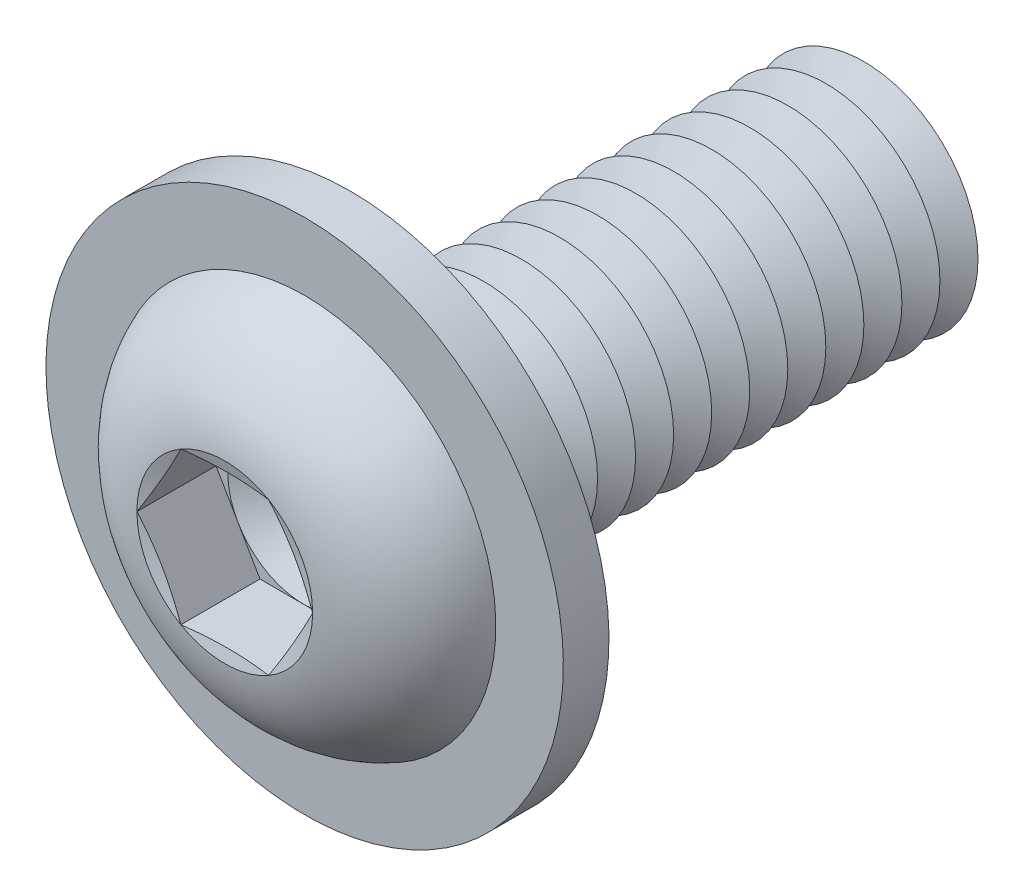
from build123d import *

# Parameters (mm, degrees)
FILLET1_R           = 0.5
LPATTERN1_COUNT     = 14
LPATTERN1_PITCH     = 1
CUT_EXTRUDE1_DEPTH  = 2.08
SKETCH5_R           = 6.8
SKETCH5_R_2         = 3.5
BOSS_EXTRUDE1_DEPTH = 1.2


with BuildPart() as part:
    # Sketch1 → Revolve1 (revolve)
    with BuildSketch(Plane(origin=(0, 0, 0), x_dir=(0, 0, -1), z_dir=(1, 0, 0)), mode=Mode.PRIVATE) as revolve1_sk:
        with BuildLine():
            Line((0, 3), (0, 5.25))
            ThreePointArc((0, 5.25), (-2.210041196, 4.408189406), (-3.3, 2.3094))
            Line((-3.3, 2.3094), (-2.990599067, 1.1547))
            Line((-2.990599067, 1.1547), (-3.3, 1.1547))
            Line((-3.3, 1.1547), (-3.3, 0))
            Line((-3.3, 0), (14, 0))
            Line((14, 0), (14, 3))
            Line((14, 3), (0, 3))
        make_face()
    revolve(revolve1_sk.sketch.rotate(Axis((0, 0, -14), (0, 0, 1)), 90), axis=Axis((0, 0, -14), (0, 0, 1)))

    # Fillet1
    fillet1_edges = [part.edges().sort_by_distance(p)[0] for p in [
        (3, 0, 0),
    ]]
    fillet(fillet1_edges, radius=FILLET1_R)

    # Sketch2 → Cut-Revolve1 (revolve, cut)
    with BuildSketch(Plane(origin=(0, 0, 0), x_dir=(0, 0, -1), z_dir=(1, 0, 0)), mode=Mode.PRIVATE) as cut_revolve1_sk:
        Polygon((13.5, 3), (14.5, 3), (14, 2.133974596), align=None)
    cut_revolve1 = revolve(cut_revolve1_sk.sketch.rotate(Axis((0, 0, -14), (0, 0, -1)), 270), axis=Axis((0, 0, -14), (0, 0, -1)), mode=Mode.SUBTRACT)

    # LPattern1: Cut-Revolve1 ×14
    with Locations(*[(0, 0, i * LPATTERN1_PITCH) for i in range(1, LPATTERN1_COUNT)]):
        add(cut_revolve1, mode=Mode.SUBTRACT)

    # Sketch3 → Cut-Extrude1 (cut)
    with BuildSketch(Plane.XY.offset(3.3)):
        Polygon((1.1547, 1.999999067), (-1.1547, 1.999999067), (-2.3094, 0), (-1.1547, -1.999999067), (1.1547, -1.999999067), (2.3094, 0), align=None)
    extrude(amount=-CUT_EXTRUDE1_DEPTH, mode=Mode.SUBTRACT)

    # Cut-Extrude2 cone 1 section (on through the dimple's axis) → Cut-Extrude2 (revolve, cut)
    with BuildSketch(Plane(origin=(0, 0, 1.22), x_dir=(0, -1, 0), z_dir=(1, 0, 0))):
        Polygon((0, 0), (1.999999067, 0), (0, 1.1547), align=None)
    revolve(axis=Axis((0, 0, 1.22), (0, 0, -1)), mode=Mode.SUBTRACT)

    # Sketch5 → Boss-Extrude1 (add)
    with BuildSketch(Plane(origin=(0, 0, 0), x_dir=(-1, 0, 0), z_dir=(0, 0, -1))):
        with Locations(Location((0, 0, 0), (0, 0, 90))):
            Circle(SKETCH5_R)
        Circle(SKETCH5_R_2, mode=Mode.SUBTRACT)
    extrude(amount=-BOSS_EXTRUDE1_DEPTH)


solid = part.part
